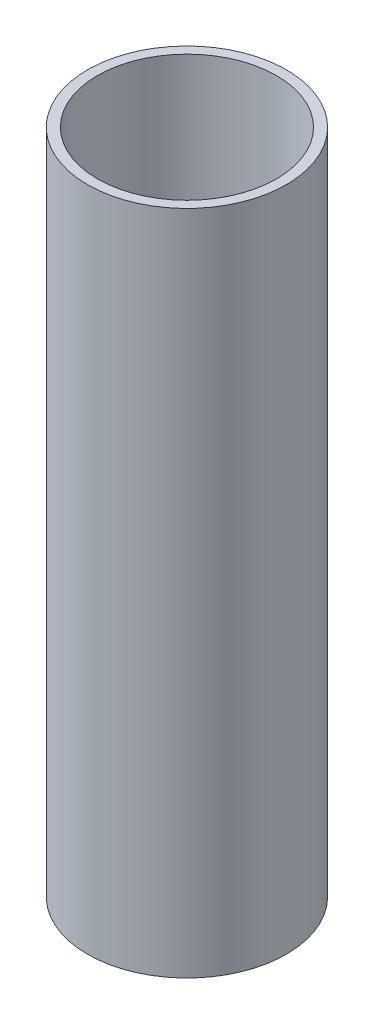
ISO-10303-21;
HEADER;
FILE_DESCRIPTION(('STEP AP214'),'2;1');
FILE_NAME('part.step','',(''),(''),'','','');
FILE_SCHEMA(('AUTOMOTIVE_DESIGN { 1 0 10303 214 1 1 1 1 }'));
ENDSEC;
DATA;
#1=APPLICATION_CONTEXT('core data for automotive mechanical design processes');
#2=APPLICATION_PROTOCOL_DEFINITION('international standard','automotive_design',2000,#1);
#3=PRODUCT_CONTEXT('',#1,'mechanical');
#4=PRODUCT('Part','Part','',(#3));
#5=PRODUCT_RELATED_PRODUCT_CATEGORY('part','',(#4));
#6=PRODUCT_DEFINITION_FORMATION('','',#4);
#7=PRODUCT_DEFINITION_CONTEXT('part definition',#1,'design');
#8=PRODUCT_DEFINITION('design','',#6,#7);
#9=PRODUCT_DEFINITION_SHAPE('','',#8);
#10=(LENGTH_UNIT() NAMED_UNIT(*) SI_UNIT(.MILLI.,.METRE.));
#11=(NAMED_UNIT(*) PLANE_ANGLE_UNIT() SI_UNIT($,.RADIAN.));
#12=(NAMED_UNIT(*) SI_UNIT($,.STERADIAN.) SOLID_ANGLE_UNIT());
#13=UNCERTAINTY_MEASURE_WITH_UNIT(LENGTH_MEASURE(1.E-05),#10,'distance_accuracy_value','');
#14=(GEOMETRIC_REPRESENTATION_CONTEXT(3) GLOBAL_UNCERTAINTY_ASSIGNED_CONTEXT((#13)) GLOBAL_UNIT_ASSIGNED_CONTEXT((#10,
#11,#12)) REPRESENTATION_CONTEXT('',''));
#15=CARTESIAN_POINT('',(0.,0.,0.));
#16=DIRECTION('',(0.,0.,1.));
#17=DIRECTION('',(1.,0.,0.));
#18=AXIS2_PLACEMENT_3D('',#15,#16,#17);
#19=CARTESIAN_POINT('',(0.,268.,0.));
#20=DIRECTION('',(0.,1.,0.));
#21=DIRECTION('',(0.,0.,1.));
#22=AXIS2_PLACEMENT_3D('',#19,#20,#21);
#23=PLANE('',#22);
#24=CARTESIAN_POINT('',(0.,268.,0.));
#25=DIRECTION('',(0.,1.,0.));
#26=DIRECTION('',(0.,0.,1.));
#27=AXIS2_PLACEMENT_3D('',#24,#25,#26);
#28=CIRCLE('',#27,40.);
#29=CARTESIAN_POINT('',(0.,268.,40.));
#30=VERTEX_POINT('',#29);
#31=EDGE_CURVE('E10',#30,#30,#28,.T.);
#32=ORIENTED_EDGE('',*,*,#31,.T.);
#33=EDGE_LOOP('',(#32));
#34=FACE_BOUND('',#33,.T.);
#35=CARTESIAN_POINT('',(0.,268.,0.));
#36=DIRECTION('',(0.,1.,0.));
#37=DIRECTION('',(0.,0.,1.));
#38=AXIS2_PLACEMENT_3D('',#35,#36,#37);
#39=CIRCLE('',#38,36.);
#40=CARTESIAN_POINT('',(0.,268.,36.));
#41=VERTEX_POINT('',#40);
#42=EDGE_CURVE('E37',#41,#41,#39,.T.);
#43=ORIENTED_EDGE('',*,*,#42,.F.);
#44=EDGE_LOOP('',(#43));
#45=FACE_BOUND('',#44,.T.);
#46=ADVANCED_FACE('F26',(#34,#45),#23,.T.);
#47=CARTESIAN_POINT('',(0.,0.,0.));
#48=DIRECTION('',(0.,1.,0.));
#49=DIRECTION('',(0.,0.,1.));
#50=AXIS2_PLACEMENT_3D('',#47,#48,#49);
#51=PLANE('',#50);
#52=CARTESIAN_POINT('',(0.,0.,0.));
#53=DIRECTION('',(0.,1.,0.));
#54=DIRECTION('',(0.,0.,1.));
#55=AXIS2_PLACEMENT_3D('',#52,#53,#54);
#56=CIRCLE('',#55,40.);
#57=CARTESIAN_POINT('',(0.,0.,40.));
#58=VERTEX_POINT('',#57);
#59=EDGE_CURVE('E30',#58,#58,#56,.T.);
#60=ORIENTED_EDGE('',*,*,#59,.F.);
#61=EDGE_LOOP('',(#60));
#62=FACE_BOUND('',#61,.T.);
#63=CARTESIAN_POINT('',(0.,0.,0.));
#64=DIRECTION('',(0.,1.,0.));
#65=DIRECTION('',(0.,0.,1.));
#66=AXIS2_PLACEMENT_3D('',#63,#64,#65);
#67=CIRCLE('',#66,36.);
#68=CARTESIAN_POINT('',(0.,0.,36.));
#69=VERTEX_POINT('',#68);
#70=EDGE_CURVE('E39',#69,#69,#67,.T.);
#71=ORIENTED_EDGE('',*,*,#70,.T.);
#72=EDGE_LOOP('',(#71));
#73=FACE_BOUND('',#72,.T.);
#74=ADVANCED_FACE('F49',(#62,#73),#51,.F.);
#75=CARTESIAN_POINT('',(0.,268.,0.));
#76=DIRECTION('',(0.,-1.,0.));
#77=DIRECTION('',(0.,0.,-1.));
#78=AXIS2_PLACEMENT_3D('',#75,#76,#77);
#79=CYLINDRICAL_SURFACE('',#78,40.);
#80=ORIENTED_EDGE('',*,*,#31,.F.);
#81=EDGE_LOOP('',(#80));
#82=FACE_BOUND('',#81,.T.);
#83=ORIENTED_EDGE('',*,*,#59,.T.);
#84=EDGE_LOOP('',(#83));
#85=FACE_BOUND('',#84,.T.);
#86=ADVANCED_FACE('F28',(#82,#85),#79,.T.);
#87=CARTESIAN_POINT('',(0.,268.,0.));
#88=DIRECTION('',(0.,-1.,0.));
#89=DIRECTION('',(0.,0.,-1.));
#90=AXIS2_PLACEMENT_3D('',#87,#88,#89);
#91=CYLINDRICAL_SURFACE('',#90,36.);
#92=ORIENTED_EDGE('',*,*,#42,.T.);
#93=EDGE_LOOP('',(#92));
#94=FACE_BOUND('',#93,.T.);
#95=ORIENTED_EDGE('',*,*,#70,.F.);
#96=EDGE_LOOP('',(#95));
#97=FACE_BOUND('',#96,.T.);
#98=ADVANCED_FACE('F45',(#94,#97),#91,.F.);
#99=CLOSED_SHELL('',(#46,#74,#86,#98));
#100=MANIFOLD_SOLID_BREP('B2',#99);
#101=ADVANCED_BREP_SHAPE_REPRESENTATION('',(#18,#100),#14);
#102=SHAPE_DEFINITION_REPRESENTATION(#9,#101);
ENDSEC;
END-ISO-10303-21;
